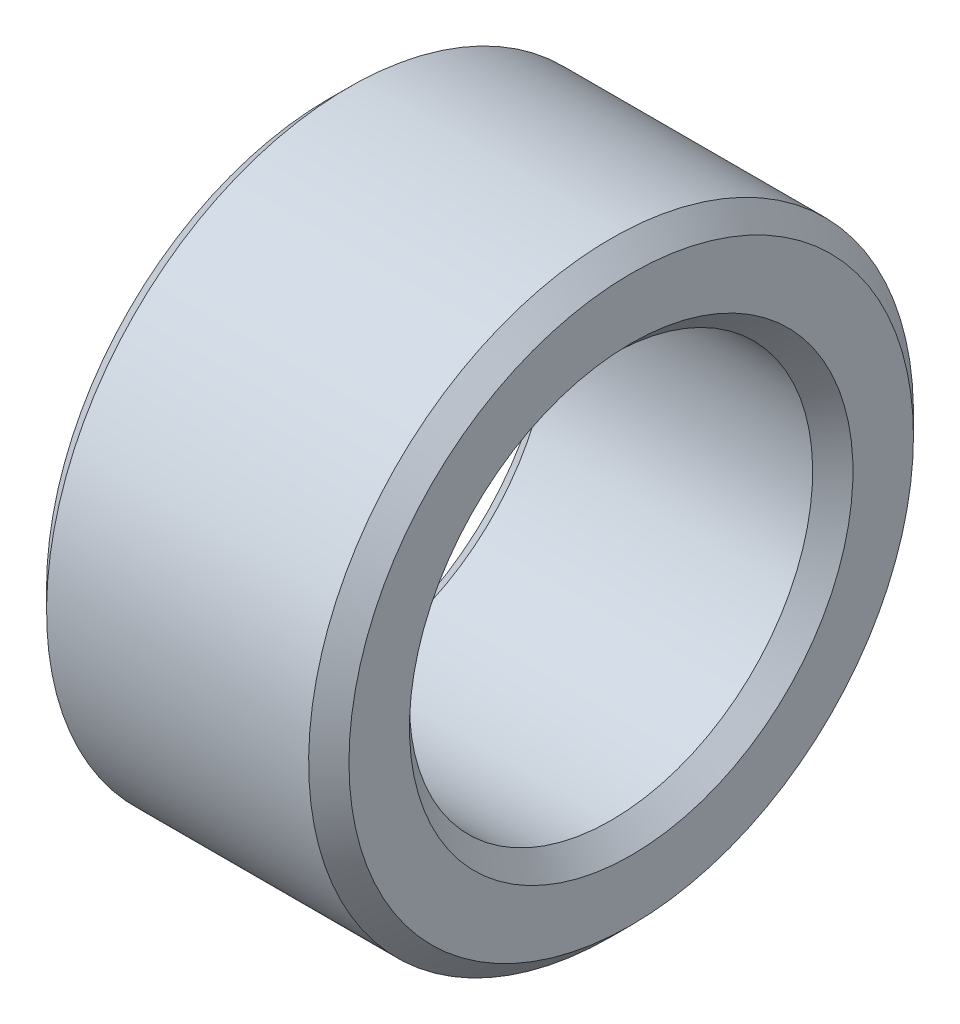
ISO-10303-21;
HEADER;
FILE_DESCRIPTION(('STEP AP214'),'2;1');
FILE_NAME('part.step','',(''),(''),'','','');
FILE_SCHEMA(('AUTOMOTIVE_DESIGN { 1 0 10303 214 1 1 1 1 }'));
ENDSEC;
DATA;
#1=APPLICATION_CONTEXT('core data for automotive mechanical design processes');
#2=APPLICATION_PROTOCOL_DEFINITION('international standard','automotive_design',2000,#1);
#3=PRODUCT_CONTEXT('',#1,'mechanical');
#4=PRODUCT('Part','Part','',(#3));
#5=PRODUCT_RELATED_PRODUCT_CATEGORY('part','',(#4));
#6=PRODUCT_DEFINITION_FORMATION('','',#4);
#7=PRODUCT_DEFINITION_CONTEXT('part definition',#1,'design');
#8=PRODUCT_DEFINITION('design','',#6,#7);
#9=PRODUCT_DEFINITION_SHAPE('','',#8);
#10=(LENGTH_UNIT() NAMED_UNIT(*) SI_UNIT(.MILLI.,.METRE.));
#11=(NAMED_UNIT(*) PLANE_ANGLE_UNIT() SI_UNIT($,.RADIAN.));
#12=(NAMED_UNIT(*) SI_UNIT($,.STERADIAN.) SOLID_ANGLE_UNIT());
#13=UNCERTAINTY_MEASURE_WITH_UNIT(LENGTH_MEASURE(1.E-05),#10,'distance_accuracy_value','');
#14=(GEOMETRIC_REPRESENTATION_CONTEXT(3) GLOBAL_UNCERTAINTY_ASSIGNED_CONTEXT((#13)) GLOBAL_UNIT_ASSIGNED_CONTEXT((#10,
#11,#12)) REPRESENTATION_CONTEXT('',''));
#15=CARTESIAN_POINT('',(0.,0.,0.));
#16=DIRECTION('',(0.,0.,1.));
#17=DIRECTION('',(1.,0.,0.));
#18=AXIS2_PLACEMENT_3D('',#15,#16,#17);
#19=CARTESIAN_POINT('',(0.,-5.,0.));
#20=DIRECTION('',(-1.,0.,0.));
#21=DIRECTION('',(0.,1.,0.));
#22=AXIS2_PLACEMENT_3D('',#19,#20,#21);
#23=PLANE('',#22);
#24=CARTESIAN_POINT('',(0.,0.,0.));
#25=DIRECTION('',(1.,0.,0.));
#26=DIRECTION('',(0.,-1.,0.));
#27=AXIS2_PLACEMENT_3D('',#24,#25,#26);
#28=CIRCLE('',#27,4.4);
#29=CARTESIAN_POINT('',(0.,-4.4,0.));
#30=VERTEX_POINT('',#29);
#31=EDGE_CURVE('E9',#30,#30,#28,.T.);
#32=ORIENTED_EDGE('',*,*,#31,.T.);
#33=EDGE_LOOP('',(#32));
#34=FACE_BOUND('',#33,.T.);
#35=CARTESIAN_POINT('',(0.,0.,0.));
#36=DIRECTION('',(1.,0.,0.));
#37=DIRECTION('',(0.,-1.,0.));
#38=AXIS2_PLACEMENT_3D('',#35,#36,#37);
#39=CIRCLE('',#38,5.6);
#40=CARTESIAN_POINT('',(0.,-5.6,0.));
#41=VERTEX_POINT('',#40);
#42=EDGE_CURVE('E53',#41,#41,#39,.T.);
#43=ORIENTED_EDGE('',*,*,#42,.F.);
#44=EDGE_LOOP('',(#43));
#45=FACE_BOUND('',#44,.T.);
#46=ADVANCED_FACE('F15',(#34,#45),#23,.T.);
#47=CARTESIAN_POINT('',(0.2,0.,0.));
#48=DIRECTION('',(-1.,0.,0.));
#49=DIRECTION('',(0.,-1.,0.));
#50=AXIS2_PLACEMENT_3D('',#47,#48,#49);
#51=CONICAL_SURFACE('',#50,4.2,0.785398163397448);
#52=CARTESIAN_POINT('',(0.4,0.,0.));
#53=DIRECTION('',(1.,0.,0.));
#54=DIRECTION('',(0.,-1.,0.));
#55=AXIS2_PLACEMENT_3D('',#52,#53,#54);
#56=CIRCLE('',#55,4.);
#57=CARTESIAN_POINT('',(0.4,-4.,0.));
#58=VERTEX_POINT('',#57);
#59=EDGE_CURVE('E22',#58,#58,#56,.T.);
#60=ORIENTED_EDGE('',*,*,#59,.T.);
#61=EDGE_LOOP('',(#60));
#62=FACE_BOUND('',#61,.T.);
#63=ORIENTED_EDGE('',*,*,#31,.F.);
#64=EDGE_LOOP('',(#63));
#65=FACE_BOUND('',#64,.T.);
#66=ADVANCED_FACE('F82',(#62,#65),#51,.F.);
#67=CARTESIAN_POINT('',(3.,0.,0.));
#68=DIRECTION('',(-1.,0.,0.));
#69=DIRECTION('',(0.,-1.,0.));
#70=AXIS2_PLACEMENT_3D('',#67,#68,#69);
#71=CYLINDRICAL_SURFACE('',#70,4.);
#72=CARTESIAN_POINT('',(5.6,0.,0.));
#73=DIRECTION('',(1.,0.,0.));
#74=DIRECTION('',(0.,-1.,0.));
#75=AXIS2_PLACEMENT_3D('',#72,#73,#74);
#76=CIRCLE('',#75,4.);
#77=CARTESIAN_POINT('',(5.6,-4.,0.));
#78=VERTEX_POINT('',#77);
#79=EDGE_CURVE('E58',#78,#78,#76,.T.);
#80=ORIENTED_EDGE('',*,*,#79,.T.);
#81=EDGE_LOOP('',(#80));
#82=FACE_BOUND('',#81,.T.);
#83=ORIENTED_EDGE('',*,*,#59,.F.);
#84=EDGE_LOOP('',(#83));
#85=FACE_BOUND('',#84,.T.);
#86=ADVANCED_FACE('F66',(#82,#85),#71,.F.);
#87=CARTESIAN_POINT('',(5.8,0.,0.));
#88=DIRECTION('',(1.,0.,0.));
#89=DIRECTION('',(0.,-1.,0.));
#90=AXIS2_PLACEMENT_3D('',#87,#88,#89);
#91=CONICAL_SURFACE('',#90,4.2,0.785398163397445);
#92=CARTESIAN_POINT('',(6.,0.,0.));
#93=DIRECTION('',(1.,0.,0.));
#94=DIRECTION('',(0.,-1.,0.));
#95=AXIS2_PLACEMENT_3D('',#92,#93,#94);
#96=CIRCLE('',#95,4.4);
#97=CARTESIAN_POINT('',(6.,-4.4,0.));
#98=VERTEX_POINT('',#97);
#99=EDGE_CURVE('E63',#98,#98,#96,.T.);
#100=ORIENTED_EDGE('',*,*,#99,.T.);
#101=EDGE_LOOP('',(#100));
#102=FACE_BOUND('',#101,.T.);
#103=ORIENTED_EDGE('',*,*,#79,.F.);
#104=EDGE_LOOP('',(#103));
#105=FACE_BOUND('',#104,.T.);
#106=ADVANCED_FACE('F69',(#102,#105),#91,.F.);
#107=CARTESIAN_POINT('',(6.,-5.,0.));
#108=DIRECTION('',(1.,0.,0.));
#109=DIRECTION('',(0.,-1.,0.));
#110=AXIS2_PLACEMENT_3D('',#107,#108,#109);
#111=PLANE('',#110);
#112=CARTESIAN_POINT('',(6.,0.,0.));
#113=DIRECTION('',(1.,0.,0.));
#114=DIRECTION('',(0.,-1.,0.));
#115=AXIS2_PLACEMENT_3D('',#112,#113,#114);
#116=CIRCLE('',#115,5.6);
#117=CARTESIAN_POINT('',(6.,-5.6,0.));
#118=VERTEX_POINT('',#117);
#119=EDGE_CURVE('E61',#118,#118,#116,.T.);
#120=ORIENTED_EDGE('',*,*,#119,.T.);
#121=EDGE_LOOP('',(#120));
#122=FACE_BOUND('',#121,.T.);
#123=ORIENTED_EDGE('',*,*,#99,.F.);
#124=EDGE_LOOP('',(#123));
#125=FACE_BOUND('',#124,.T.);
#126=ADVANCED_FACE('F71',(#122,#125),#111,.T.);
#127=CARTESIAN_POINT('',(5.8,0.,0.));
#128=DIRECTION('',(-1.,0.,0.));
#129=DIRECTION('',(0.,-1.,0.));
#130=AXIS2_PLACEMENT_3D('',#127,#128,#129);
#131=CONICAL_SURFACE('',#130,5.8,0.785398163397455);
#132=CARTESIAN_POINT('',(5.6,0.,0.));
#133=DIRECTION('',(1.,0.,0.));
#134=DIRECTION('',(0.,-1.,0.));
#135=AXIS2_PLACEMENT_3D('',#132,#133,#134);
#136=CIRCLE('',#135,6.);
#137=CARTESIAN_POINT('',(5.6,-6.,0.));
#138=VERTEX_POINT('',#137);
#139=EDGE_CURVE('E55',#138,#138,#136,.T.);
#140=ORIENTED_EDGE('',*,*,#139,.T.);
#141=EDGE_LOOP('',(#140));
#142=FACE_BOUND('',#141,.T.);
#143=ORIENTED_EDGE('',*,*,#119,.F.);
#144=EDGE_LOOP('',(#143));
#145=FACE_BOUND('',#144,.T.);
#146=ADVANCED_FACE('F79',(#142,#145),#131,.T.);
#147=CARTESIAN_POINT('',(3.,0.,0.));
#148=DIRECTION('',(-1.,0.,0.));
#149=DIRECTION('',(0.,-1.,0.));
#150=AXIS2_PLACEMENT_3D('',#147,#148,#149);
#151=CYLINDRICAL_SURFACE('',#150,6.);
#152=CARTESIAN_POINT('',(0.4,0.,0.));
#153=DIRECTION('',(1.,0.,0.));
#154=DIRECTION('',(0.,-1.,0.));
#155=AXIS2_PLACEMENT_3D('',#152,#153,#154);
#156=CIRCLE('',#155,6.);
#157=CARTESIAN_POINT('',(0.4,-6.,0.));
#158=VERTEX_POINT('',#157);
#159=EDGE_CURVE('E49',#158,#158,#156,.T.);
#160=ORIENTED_EDGE('',*,*,#159,.T.);
#161=EDGE_LOOP('',(#160));
#162=FACE_BOUND('',#161,.T.);
#163=ORIENTED_EDGE('',*,*,#139,.F.);
#164=EDGE_LOOP('',(#163));
#165=FACE_BOUND('',#164,.T.);
#166=ADVANCED_FACE('F50',(#162,#165),#151,.T.);
#167=CARTESIAN_POINT('',(0.2,0.,0.));
#168=DIRECTION('',(1.,0.,0.));
#169=DIRECTION('',(0.,-1.,0.));
#170=AXIS2_PLACEMENT_3D('',#167,#168,#169);
#171=CONICAL_SURFACE('',#170,5.8,0.785398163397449);
#172=ORIENTED_EDGE('',*,*,#42,.T.);
#173=EDGE_LOOP('',(#172));
#174=FACE_BOUND('',#173,.T.);
#175=ORIENTED_EDGE('',*,*,#159,.F.);
#176=EDGE_LOOP('',(#175));
#177=FACE_BOUND('',#176,.T.);
#178=ADVANCED_FACE('F92',(#174,#177),#171,.T.);
#179=CLOSED_SHELL('',(#46,#66,#86,#106,#126,#146,#166,#178));
#180=MANIFOLD_SOLID_BREP('B1',#179);
#181=ADVANCED_BREP_SHAPE_REPRESENTATION('',(#18,#180),#14);
#182=SHAPE_DEFINITION_REPRESENTATION(#9,#181);
ENDSEC;
END-ISO-10303-21;
